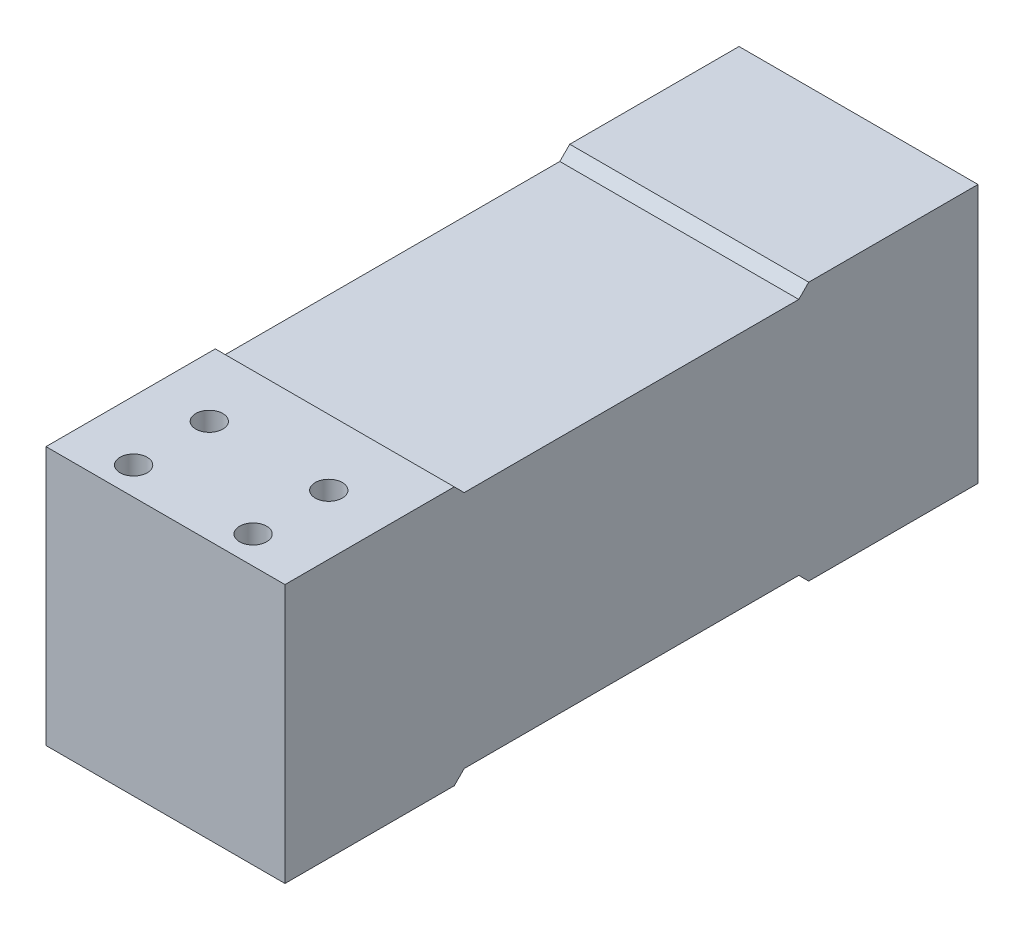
ISO-10303-21;
HEADER;
FILE_DESCRIPTION(('STEP AP214'),'2;1');
FILE_NAME('part.step','',(''),(''),'','','');
FILE_SCHEMA(('AUTOMOTIVE_DESIGN { 1 0 10303 214 1 1 1 1 }'));
ENDSEC;
DATA;
#1=APPLICATION_CONTEXT('core data for automotive mechanical design processes');
#2=APPLICATION_PROTOCOL_DEFINITION('international standard','automotive_design',2000,#1);
#3=PRODUCT_CONTEXT('',#1,'mechanical');
#4=PRODUCT('Part','Part','',(#3));
#5=PRODUCT_RELATED_PRODUCT_CATEGORY('part','',(#4));
#6=PRODUCT_DEFINITION_FORMATION('','',#4);
#7=PRODUCT_DEFINITION_CONTEXT('part definition',#1,'design');
#8=PRODUCT_DEFINITION('design','',#6,#7);
#9=PRODUCT_DEFINITION_SHAPE('','',#8);
#10=(LENGTH_UNIT() NAMED_UNIT(*) SI_UNIT(.MILLI.,.METRE.));
#11=(NAMED_UNIT(*) PLANE_ANGLE_UNIT() SI_UNIT($,.RADIAN.));
#12=(NAMED_UNIT(*) SI_UNIT($,.STERADIAN.) SOLID_ANGLE_UNIT());
#13=UNCERTAINTY_MEASURE_WITH_UNIT(LENGTH_MEASURE(1.E-05),#10,'distance_accuracy_value','');
#14=(GEOMETRIC_REPRESENTATION_CONTEXT(3) GLOBAL_UNCERTAINTY_ASSIGNED_CONTEXT((#13)) GLOBAL_UNIT_ASSIGNED_CONTEXT((#10,
#11,#12)) REPRESENTATION_CONTEXT('',''));
#15=CARTESIAN_POINT('',(0.,0.,0.));
#16=DIRECTION('',(0.,0.,1.));
#17=DIRECTION('',(1.,0.,0.));
#18=AXIS2_PLACEMENT_3D('',#15,#16,#17);
#19=CARTESIAN_POINT('',(30.,0.,0.));
#20=DIRECTION('',(0.,0.,-1.));
#21=DIRECTION('',(-1.,0.,0.));
#22=AXIS2_PLACEMENT_3D('',#19,#20,#21);
#23=PLANE('',#22);
#24=DIRECTION('',(0.,-1.,0.));
#25=VECTOR('',#24,1.);
#26=CARTESIAN_POINT('',(-30.,0.,0.));
#27=LINE('',#26,#25);
#28=CARTESIAN_POINT('',(-30.,65.,0.));
#29=VERTEX_POINT('',#28);
#30=CARTESIAN_POINT('',(-30.,0.,0.));
#31=VERTEX_POINT('',#30);
#32=EDGE_CURVE('E159',#29,#31,#27,.T.);
#33=ORIENTED_EDGE('',*,*,#32,.T.);
#34=DIRECTION('',(-1.,0.,0.));
#35=VECTOR('',#34,1.);
#36=CARTESIAN_POINT('',(30.,0.,0.));
#37=LINE('',#36,#35);
#38=CARTESIAN_POINT('',(30.,0.,0.));
#39=VERTEX_POINT('',#38);
#40=EDGE_CURVE('E11',#39,#31,#37,.T.);
#41=ORIENTED_EDGE('',*,*,#40,.F.);
#42=DIRECTION('',(0.,-1.,0.));
#43=VECTOR('',#42,1.);
#44=CARTESIAN_POINT('',(30.,0.,0.));
#45=LINE('',#44,#43);
#46=CARTESIAN_POINT('',(30.,65.,0.));
#47=VERTEX_POINT('',#46);
#48=EDGE_CURVE('E182',#47,#39,#45,.T.);
#49=ORIENTED_EDGE('',*,*,#48,.F.);
#50=DIRECTION('',(-1.,0.,0.));
#51=VECTOR('',#50,1.);
#52=CARTESIAN_POINT('',(30.,65.,0.));
#53=LINE('',#52,#51);
#54=EDGE_CURVE('E155',#47,#29,#53,.T.);
#55=ORIENTED_EDGE('',*,*,#54,.T.);
#56=EDGE_LOOP('',(#33,#41,#49,#55));
#57=FACE_BOUND('',#56,.T.);
#58=ADVANCED_FACE('F36',(#57),#23,.F.);
#59=CARTESIAN_POINT('',(30.,0.,0.));
#60=DIRECTION('',(0.,1.,0.));
#61=DIRECTION('',(0.,0.,1.));
#62=AXIS2_PLACEMENT_3D('',#59,#60,#61);
#63=PLANE('',#62);
#64=DIRECTION('',(0.,0.,-1.));
#65=VECTOR('',#64,1.);
#66=CARTESIAN_POINT('',(-30.,0.,0.));
#67=LINE('',#66,#65);
#68=CARTESIAN_POINT('',(-30.,0.,-42.5));
#69=VERTEX_POINT('',#68);
#70=EDGE_CURVE('E162',#31,#69,#67,.T.);
#71=ORIENTED_EDGE('',*,*,#70,.T.);
#72=DIRECTION('',(-1.,0.,0.));
#73=VECTOR('',#72,1.);
#74=CARTESIAN_POINT('',(30.,0.,-42.5));
#75=LINE('',#74,#73);
#76=CARTESIAN_POINT('',(30.,0.,-42.5));
#77=VERTEX_POINT('',#76);
#78=EDGE_CURVE('E44',#77,#69,#75,.T.);
#79=ORIENTED_EDGE('',*,*,#78,.F.);
#80=DIRECTION('',(0.,0.,-1.));
#81=VECTOR('',#80,1.);
#82=CARTESIAN_POINT('',(30.,0.,0.));
#83=LINE('',#82,#81);
#84=EDGE_CURVE('E108',#39,#77,#83,.T.);
#85=ORIENTED_EDGE('',*,*,#84,.F.);
#86=ORIENTED_EDGE('',*,*,#40,.T.);
#87=EDGE_LOOP('',(#71,#79,#85,#86));
#88=FACE_BOUND('',#87,.T.);
#89=ADVANCED_FACE('F263',(#88),#63,.F.);
#90=CARTESIAN_POINT('',(30.,0.,-42.5));
#91=DIRECTION('',(0.,0.707106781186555,0.70710678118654));
#92=DIRECTION('',(0.,-0.70710678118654,0.707106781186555));
#93=AXIS2_PLACEMENT_3D('',#90,#91,#92);
#94=PLANE('',#93);
#95=DIRECTION('',(0.,0.70710678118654,-0.707106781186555));
#96=VECTOR('',#95,1.);
#97=CARTESIAN_POINT('',(-30.,0.,-42.5));
#98=LINE('',#97,#96);
#99=CARTESIAN_POINT('',(-30.,2.50000000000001,-45.0000000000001));
#100=VERTEX_POINT('',#99);
#101=EDGE_CURVE('E165',#69,#100,#98,.T.);
#102=ORIENTED_EDGE('',*,*,#101,.T.);
#103=DIRECTION('',(-1.,0.,0.));
#104=VECTOR('',#103,1.);
#105=CARTESIAN_POINT('',(30.,2.50000000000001,-45.0000000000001));
#106=LINE('',#105,#104);
#107=CARTESIAN_POINT('',(30.,2.50000000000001,-45.0000000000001));
#108=VERTEX_POINT('',#107);
#109=EDGE_CURVE('E201',#108,#100,#106,.T.);
#110=ORIENTED_EDGE('',*,*,#109,.F.);
#111=DIRECTION('',(0.,0.70710678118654,-0.707106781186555));
#112=VECTOR('',#111,1.);
#113=CARTESIAN_POINT('',(30.,0.,-42.5));
#114=LINE('',#113,#112);
#115=EDGE_CURVE('E209',#77,#108,#114,.T.);
#116=ORIENTED_EDGE('',*,*,#115,.F.);
#117=ORIENTED_EDGE('',*,*,#78,.T.);
#118=EDGE_LOOP('',(#102,#110,#116,#117));
#119=FACE_BOUND('',#118,.T.);
#120=ADVANCED_FACE('F207',(#119),#94,.F.);
#121=CARTESIAN_POINT('',(30.,2.50000000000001,-45.0000000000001));
#122=DIRECTION('',(0.,1.,0.));
#123=DIRECTION('',(0.,0.,1.));
#124=AXIS2_PLACEMENT_3D('',#121,#122,#123);
#125=PLANE('',#124);
#126=DIRECTION('',(0.,0.,-1.));
#127=VECTOR('',#126,1.);
#128=CARTESIAN_POINT('',(-30.,2.50000000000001,-45.0000000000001));
#129=LINE('',#128,#127);
#130=CARTESIAN_POINT('',(-30.,2.50000000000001,-129.));
#131=VERTEX_POINT('',#130);
#132=EDGE_CURVE('E167',#100,#131,#129,.T.);
#133=ORIENTED_EDGE('',*,*,#132,.T.);
#134=DIRECTION('',(-1.,0.,0.));
#135=VECTOR('',#134,1.);
#136=CARTESIAN_POINT('',(30.,2.50000000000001,-129.));
#137=LINE('',#136,#135);
#138=CARTESIAN_POINT('',(30.,2.50000000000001,-129.));
#139=VERTEX_POINT('',#138);
#140=EDGE_CURVE('E198',#139,#131,#137,.T.);
#141=ORIENTED_EDGE('',*,*,#140,.F.);
#142=DIRECTION('',(0.,0.,-1.));
#143=VECTOR('',#142,1.);
#144=CARTESIAN_POINT('',(30.,2.50000000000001,-45.0000000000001));
#145=LINE('',#144,#143);
#146=EDGE_CURVE('E227',#108,#139,#145,.T.);
#147=ORIENTED_EDGE('',*,*,#146,.F.);
#148=ORIENTED_EDGE('',*,*,#109,.T.);
#149=EDGE_LOOP('',(#133,#141,#147,#148));
#150=FACE_BOUND('',#149,.T.);
#151=ADVANCED_FACE('F218',(#150),#125,.F.);
#152=CARTESIAN_POINT('',(30.,0.,-131.5));
#153=DIRECTION('',(0.,0.707106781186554,-0.707106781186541));
#154=DIRECTION('',(0.,0.707106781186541,0.707106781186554));
#155=AXIS2_PLACEMENT_3D('',#152,#153,#154);
#156=PLANE('',#155);
#157=DIRECTION('',(0.,-0.707106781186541,-0.707106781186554));
#158=VECTOR('',#157,1.);
#159=CARTESIAN_POINT('',(-30.,0.,-131.5));
#160=LINE('',#159,#158);
#161=CARTESIAN_POINT('',(-30.,0.,-131.5));
#162=VERTEX_POINT('',#161);
#163=EDGE_CURVE('E169',#131,#162,#160,.T.);
#164=ORIENTED_EDGE('',*,*,#163,.T.);
#165=DIRECTION('',(-1.,0.,0.));
#166=VECTOR('',#165,1.);
#167=CARTESIAN_POINT('',(30.,0.,-131.5));
#168=LINE('',#167,#166);
#169=CARTESIAN_POINT('',(30.,0.,-131.5));
#170=VERTEX_POINT('',#169);
#171=EDGE_CURVE('E195',#170,#162,#168,.T.);
#172=ORIENTED_EDGE('',*,*,#171,.F.);
#173=DIRECTION('',(0.,-0.707106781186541,-0.707106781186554));
#174=VECTOR('',#173,1.);
#175=CARTESIAN_POINT('',(30.,0.,-131.5));
#176=LINE('',#175,#174);
#177=EDGE_CURVE('E224',#139,#170,#176,.T.);
#178=ORIENTED_EDGE('',*,*,#177,.F.);
#179=ORIENTED_EDGE('',*,*,#140,.T.);
#180=EDGE_LOOP('',(#164,#172,#178,#179));
#181=FACE_BOUND('',#180,.T.);
#182=ADVANCED_FACE('F222',(#181),#156,.F.);
#183=CARTESIAN_POINT('',(30.,0.,-131.5));
#184=DIRECTION('',(0.,1.,0.));
#185=DIRECTION('',(0.,0.,1.));
#186=AXIS2_PLACEMENT_3D('',#183,#184,#185);
#187=PLANE('',#186);
#188=CARTESIAN_POINT('',(15.,0.,-148.));
#189=DIRECTION('',(0.,-1.,0.));
#190=DIRECTION('',(0.,0.,-1.));
#191=AXIS2_PLACEMENT_3D('',#188,#189,#190);
#192=CIRCLE('',#191,3.39999999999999);
#193=CARTESIAN_POINT('',(15.,0.,-151.4));
#194=VERTEX_POINT('',#193);
#195=EDGE_CURVE('E524',#194,#194,#192,.T.);
#196=ORIENTED_EDGE('',*,*,#195,.F.);
#197=EDGE_LOOP('',(#196));
#198=FACE_BOUND('',#197,.T.);
#199=CARTESIAN_POINT('',(15.,0.,-167.));
#200=DIRECTION('',(0.,-1.,0.));
#201=DIRECTION('',(0.,0.,-1.));
#202=AXIS2_PLACEMENT_3D('',#199,#200,#201);
#203=CIRCLE('',#202,3.39999999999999);
#204=CARTESIAN_POINT('',(15.,0.,-170.4));
#205=VERTEX_POINT('',#204);
#206=EDGE_CURVE('E526',#205,#205,#203,.T.);
#207=ORIENTED_EDGE('',*,*,#206,.F.);
#208=EDGE_LOOP('',(#207));
#209=FACE_BOUND('',#208,.T.);
#210=CARTESIAN_POINT('',(-15.,0.,-148.));
#211=DIRECTION('',(0.,-1.,0.));
#212=DIRECTION('',(0.,0.,-1.));
#213=AXIS2_PLACEMENT_3D('',#210,#211,#212);
#214=CIRCLE('',#213,3.39999999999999);
#215=CARTESIAN_POINT('',(-15.,0.,-151.4));
#216=VERTEX_POINT('',#215);
#217=EDGE_CURVE('E534',#216,#216,#214,.T.);
#218=ORIENTED_EDGE('',*,*,#217,.F.);
#219=EDGE_LOOP('',(#218));
#220=FACE_BOUND('',#219,.T.);
#221=CARTESIAN_POINT('',(-15.,0.,-167.));
#222=DIRECTION('',(0.,-1.,0.));
#223=DIRECTION('',(0.,0.,-1.));
#224=AXIS2_PLACEMENT_3D('',#221,#222,#223);
#225=CIRCLE('',#224,3.39999999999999);
#226=CARTESIAN_POINT('',(-15.,0.,-170.4));
#227=VERTEX_POINT('',#226);
#228=EDGE_CURVE('E540',#227,#227,#225,.T.);
#229=ORIENTED_EDGE('',*,*,#228,.F.);
#230=EDGE_LOOP('',(#229));
#231=FACE_BOUND('',#230,.T.);
#232=DIRECTION('',(0.,0.,-1.));
#233=VECTOR('',#232,1.);
#234=CARTESIAN_POINT('',(-30.,0.,-131.5));
#235=LINE('',#234,#233);
#236=CARTESIAN_POINT('',(-30.,0.,-174.));
#237=VERTEX_POINT('',#236);
#238=EDGE_CURVE('E171',#162,#237,#235,.T.);
#239=ORIENTED_EDGE('',*,*,#238,.T.);
#240=DIRECTION('',(-1.,0.,0.));
#241=VECTOR('',#240,1.);
#242=CARTESIAN_POINT('',(30.,0.,-174.));
#243=LINE('',#242,#241);
#244=CARTESIAN_POINT('',(30.,0.,-174.));
#245=VERTEX_POINT('',#244);
#246=EDGE_CURVE('E192',#245,#237,#243,.T.);
#247=ORIENTED_EDGE('',*,*,#246,.F.);
#248=DIRECTION('',(0.,0.,-1.));
#249=VECTOR('',#248,1.);
#250=CARTESIAN_POINT('',(30.,0.,-131.5));
#251=LINE('',#250,#249);
#252=EDGE_CURVE('E226',#170,#245,#251,.T.);
#253=ORIENTED_EDGE('',*,*,#252,.F.);
#254=ORIENTED_EDGE('',*,*,#171,.T.);
#255=EDGE_LOOP('',(#239,#247,#253,#254));
#256=FACE_BOUND('',#255,.T.);
#257=ADVANCED_FACE('F276',(#198,#209,#220,#231,#256),#187,.F.);
#258=CARTESIAN_POINT('',(30.,0.,-174.));
#259=DIRECTION('',(0.,0.,1.));
#260=DIRECTION('',(1.,0.,0.));
#261=AXIS2_PLACEMENT_3D('',#258,#259,#260);
#262=PLANE('',#261);
#263=DIRECTION('',(0.,1.,0.));
#264=VECTOR('',#263,1.);
#265=CARTESIAN_POINT('',(-30.,0.,-174.));
#266=LINE('',#265,#264);
#267=CARTESIAN_POINT('',(-30.,65.,-174.));
#268=VERTEX_POINT('',#267);
#269=EDGE_CURVE('E173',#237,#268,#266,.T.);
#270=ORIENTED_EDGE('',*,*,#269,.T.);
#271=DIRECTION('',(-1.,0.,0.));
#272=VECTOR('',#271,1.);
#273=CARTESIAN_POINT('',(30.,65.,-174.));
#274=LINE('',#273,#272);
#275=CARTESIAN_POINT('',(30.,65.,-174.));
#276=VERTEX_POINT('',#275);
#277=EDGE_CURVE('E189',#276,#268,#274,.T.);
#278=ORIENTED_EDGE('',*,*,#277,.F.);
#279=DIRECTION('',(0.,1.,0.));
#280=VECTOR('',#279,1.);
#281=CARTESIAN_POINT('',(30.,0.,-174.));
#282=LINE('',#281,#280);
#283=EDGE_CURVE('E229',#245,#276,#282,.T.);
#284=ORIENTED_EDGE('',*,*,#283,.F.);
#285=ORIENTED_EDGE('',*,*,#246,.T.);
#286=EDGE_LOOP('',(#270,#278,#284,#285));
#287=FACE_BOUND('',#286,.T.);
#288=ADVANCED_FACE('F279',(#287),#262,.F.);
#289=CARTESIAN_POINT('',(30.,65.,-131.5));
#290=DIRECTION('',(0.,-1.,0.));
#291=DIRECTION('',(0.,0.,-1.));
#292=AXIS2_PLACEMENT_3D('',#289,#290,#291);
#293=PLANE('',#292);
#294=DIRECTION('',(0.,0.,1.));
#295=VECTOR('',#294,1.);
#296=CARTESIAN_POINT('',(-30.,65.,-131.5));
#297=LINE('',#296,#295);
#298=CARTESIAN_POINT('',(-30.,65.,-131.5));
#299=VERTEX_POINT('',#298);
#300=EDGE_CURVE('E175',#268,#299,#297,.T.);
#301=ORIENTED_EDGE('',*,*,#300,.T.);
#302=DIRECTION('',(-1.,0.,0.));
#303=VECTOR('',#302,1.);
#304=CARTESIAN_POINT('',(30.,65.,-131.5));
#305=LINE('',#304,#303);
#306=CARTESIAN_POINT('',(30.,65.,-131.5));
#307=VERTEX_POINT('',#306);
#308=EDGE_CURVE('E186',#307,#299,#305,.T.);
#309=ORIENTED_EDGE('',*,*,#308,.F.);
#310=DIRECTION('',(0.,0.,1.));
#311=VECTOR('',#310,1.);
#312=CARTESIAN_POINT('',(30.,65.,-131.5));
#313=LINE('',#312,#311);
#314=EDGE_CURVE('E235',#276,#307,#313,.T.);
#315=ORIENTED_EDGE('',*,*,#314,.F.);
#316=ORIENTED_EDGE('',*,*,#277,.T.);
#317=EDGE_LOOP('',(#301,#309,#315,#316));
#318=FACE_BOUND('',#317,.T.);
#319=ADVANCED_FACE('F241',(#318),#293,.F.);
#320=CARTESIAN_POINT('',(30.,65.,-131.5));
#321=DIRECTION('',(0.,-0.707106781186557,-0.707106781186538));
#322=DIRECTION('',(0.,0.707106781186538,-0.707106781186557));
#323=AXIS2_PLACEMENT_3D('',#320,#321,#322);
#324=PLANE('',#323);
#325=DIRECTION('',(0.,-0.707106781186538,0.707106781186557));
#326=VECTOR('',#325,1.);
#327=CARTESIAN_POINT('',(-30.,65.,-131.5));
#328=LINE('',#327,#326);
#329=CARTESIAN_POINT('',(-30.,62.5,-129.));
#330=VERTEX_POINT('',#329);
#331=EDGE_CURVE('E177',#299,#330,#328,.T.);
#332=ORIENTED_EDGE('',*,*,#331,.T.);
#333=DIRECTION('',(-1.,0.,0.));
#334=VECTOR('',#333,1.);
#335=CARTESIAN_POINT('',(30.,62.5,-129.));
#336=LINE('',#335,#334);
#337=CARTESIAN_POINT('',(30.,62.5,-129.));
#338=VERTEX_POINT('',#337);
#339=EDGE_CURVE('E150',#338,#330,#336,.T.);
#340=ORIENTED_EDGE('',*,*,#339,.F.);
#341=DIRECTION('',(0.,-0.707106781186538,0.707106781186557));
#342=VECTOR('',#341,1.);
#343=CARTESIAN_POINT('',(30.,65.,-131.5));
#344=LINE('',#343,#342);
#345=EDGE_CURVE('E141',#307,#338,#344,.T.);
#346=ORIENTED_EDGE('',*,*,#345,.F.);
#347=ORIENTED_EDGE('',*,*,#308,.T.);
#348=EDGE_LOOP('',(#332,#340,#346,#347));
#349=FACE_BOUND('',#348,.T.);
#350=ADVANCED_FACE('F245',(#349),#324,.F.);
#351=CARTESIAN_POINT('',(30.,62.5,-45.));
#352=DIRECTION('',(0.,-1.,0.));
#353=DIRECTION('',(0.,0.,-1.));
#354=AXIS2_PLACEMENT_3D('',#351,#352,#353);
#355=PLANE('',#354);
#356=DIRECTION('',(0.,0.,1.));
#357=VECTOR('',#356,1.);
#358=CARTESIAN_POINT('',(-30.,62.5,-45.));
#359=LINE('',#358,#357);
#360=CARTESIAN_POINT('',(-30.,62.5,-45.));
#361=VERTEX_POINT('',#360);
#362=EDGE_CURVE('E149',#330,#361,#359,.T.);
#363=ORIENTED_EDGE('',*,*,#362,.T.);
#364=DIRECTION('',(-1.,0.,0.));
#365=VECTOR('',#364,1.);
#366=CARTESIAN_POINT('',(30.,62.5,-45.));
#367=LINE('',#366,#365);
#368=CARTESIAN_POINT('',(30.,62.5,-45.));
#369=VERTEX_POINT('',#368);
#370=EDGE_CURVE('E146',#369,#361,#367,.T.);
#371=ORIENTED_EDGE('',*,*,#370,.F.);
#372=DIRECTION('',(0.,0.,1.));
#373=VECTOR('',#372,1.);
#374=CARTESIAN_POINT('',(30.,62.5,-45.));
#375=LINE('',#374,#373);
#376=EDGE_CURVE('E135',#338,#369,#375,.T.);
#377=ORIENTED_EDGE('',*,*,#376,.F.);
#378=ORIENTED_EDGE('',*,*,#339,.T.);
#379=EDGE_LOOP('',(#363,#371,#377,#378));
#380=FACE_BOUND('',#379,.T.);
#381=ADVANCED_FACE('F147',(#380),#355,.F.);
#382=CARTESIAN_POINT('',(30.,65.,-42.5));
#383=DIRECTION('',(0.,-0.707106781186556,0.707106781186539));
#384=DIRECTION('',(0.,-0.707106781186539,-0.707106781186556));
#385=AXIS2_PLACEMENT_3D('',#382,#383,#384);
#386=PLANE('',#385);
#387=DIRECTION('',(0.,0.707106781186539,0.707106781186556));
#388=VECTOR('',#387,1.);
#389=CARTESIAN_POINT('',(-30.,65.,-42.5));
#390=LINE('',#389,#388);
#391=CARTESIAN_POINT('',(-30.,65.,-42.5));
#392=VERTEX_POINT('',#391);
#393=EDGE_CURVE('E94',#361,#392,#390,.T.);
#394=ORIENTED_EDGE('',*,*,#393,.T.);
#395=DIRECTION('',(-1.,0.,0.));
#396=VECTOR('',#395,1.);
#397=CARTESIAN_POINT('',(30.,65.,-42.5));
#398=LINE('',#397,#396);
#399=CARTESIAN_POINT('',(30.,65.,-42.5));
#400=VERTEX_POINT('',#399);
#401=EDGE_CURVE('E151',#400,#392,#398,.T.);
#402=ORIENTED_EDGE('',*,*,#401,.F.);
#403=DIRECTION('',(0.,0.707106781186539,0.707106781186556));
#404=VECTOR('',#403,1.);
#405=CARTESIAN_POINT('',(30.,65.,-42.5));
#406=LINE('',#405,#404);
#407=EDGE_CURVE('E139',#369,#400,#406,.T.);
#408=ORIENTED_EDGE('',*,*,#407,.F.);
#409=ORIENTED_EDGE('',*,*,#370,.T.);
#410=EDGE_LOOP('',(#394,#402,#408,#409));
#411=FACE_BOUND('',#410,.T.);
#412=ADVANCED_FACE('F153',(#411),#386,.F.);
#413=CARTESIAN_POINT('',(30.,65.,0.));
#414=DIRECTION('',(0.,-1.,0.));
#415=DIRECTION('',(0.,0.,-1.));
#416=AXIS2_PLACEMENT_3D('',#413,#414,#415);
#417=PLANE('',#416);
#418=CARTESIAN_POINT('',(15.,65.,-26.));
#419=DIRECTION('',(0.,1.,0.));
#420=DIRECTION('',(0.,0.,1.));
#421=AXIS2_PLACEMENT_3D('',#418,#419,#420);
#422=CIRCLE('',#421,3.4);
#423=CARTESIAN_POINT('',(15.,65.,-22.6));
#424=VERTEX_POINT('',#423);
#425=EDGE_CURVE('E546',#424,#424,#422,.T.);
#426=ORIENTED_EDGE('',*,*,#425,.F.);
#427=EDGE_LOOP('',(#426));
#428=FACE_BOUND('',#427,.T.);
#429=CARTESIAN_POINT('',(15.,65.,-7.));
#430=DIRECTION('',(0.,1.,0.));
#431=DIRECTION('',(0.,0.,1.));
#432=AXIS2_PLACEMENT_3D('',#429,#430,#431);
#433=CIRCLE('',#432,3.4);
#434=CARTESIAN_POINT('',(15.,65.,-3.6));
#435=VERTEX_POINT('',#434);
#436=EDGE_CURVE('E552',#435,#435,#433,.T.);
#437=ORIENTED_EDGE('',*,*,#436,.F.);
#438=EDGE_LOOP('',(#437));
#439=FACE_BOUND('',#438,.T.);
#440=CARTESIAN_POINT('',(-15.,65.,-26.));
#441=DIRECTION('',(0.,1.,0.));
#442=DIRECTION('',(0.,0.,1.));
#443=AXIS2_PLACEMENT_3D('',#440,#441,#442);
#444=CIRCLE('',#443,3.4);
#445=CARTESIAN_POINT('',(-15.,65.,-22.6));
#446=VERTEX_POINT('',#445);
#447=EDGE_CURVE('E558',#446,#446,#444,.T.);
#448=ORIENTED_EDGE('',*,*,#447,.F.);
#449=EDGE_LOOP('',(#448));
#450=FACE_BOUND('',#449,.T.);
#451=CARTESIAN_POINT('',(-15.,65.,-7.));
#452=DIRECTION('',(0.,1.,0.));
#453=DIRECTION('',(0.,0.,1.));
#454=AXIS2_PLACEMENT_3D('',#451,#452,#453);
#455=CIRCLE('',#454,3.4);
#456=CARTESIAN_POINT('',(-15.,65.,-3.6));
#457=VERTEX_POINT('',#456);
#458=EDGE_CURVE('E564',#457,#457,#455,.T.);
#459=ORIENTED_EDGE('',*,*,#458,.F.);
#460=EDGE_LOOP('',(#459));
#461=FACE_BOUND('',#460,.T.);
#462=DIRECTION('',(0.,0.,1.));
#463=VECTOR('',#462,1.);
#464=CARTESIAN_POINT('',(-30.,65.,0.));
#465=LINE('',#464,#463);
#466=EDGE_CURVE('E100',#392,#29,#465,.T.);
#467=ORIENTED_EDGE('',*,*,#466,.T.);
#468=ORIENTED_EDGE('',*,*,#54,.F.);
#469=DIRECTION('',(0.,0.,1.));
#470=VECTOR('',#469,1.);
#471=CARTESIAN_POINT('',(30.,65.,0.));
#472=LINE('',#471,#470);
#473=EDGE_CURVE('E52',#400,#47,#472,.T.);
#474=ORIENTED_EDGE('',*,*,#473,.F.);
#475=ORIENTED_EDGE('',*,*,#401,.T.);
#476=EDGE_LOOP('',(#467,#468,#474,#475));
#477=FACE_BOUND('',#476,.T.);
#478=ADVANCED_FACE('F249',(#428,#439,#450,#461,#477),#417,.F.);
#479=CARTESIAN_POINT('',(30.,65.,0.));
#480=DIRECTION('',(-1.,0.,0.));
#481=DIRECTION('',(0.,0.,1.));
#482=AXIS2_PLACEMENT_3D('',#479,#480,#481);
#483=PLANE('',#482);
#484=ORIENTED_EDGE('',*,*,#48,.T.);
#485=ORIENTED_EDGE('',*,*,#84,.T.);
#486=ORIENTED_EDGE('',*,*,#115,.T.);
#487=ORIENTED_EDGE('',*,*,#146,.T.);
#488=ORIENTED_EDGE('',*,*,#177,.T.);
#489=ORIENTED_EDGE('',*,*,#252,.T.);
#490=ORIENTED_EDGE('',*,*,#283,.T.);
#491=ORIENTED_EDGE('',*,*,#314,.T.);
#492=ORIENTED_EDGE('',*,*,#345,.T.);
#493=ORIENTED_EDGE('',*,*,#376,.T.);
#494=ORIENTED_EDGE('',*,*,#407,.T.);
#495=ORIENTED_EDGE('',*,*,#473,.T.);
#496=EDGE_LOOP('',(#484,#485,#486,#487,#488,#489,#490,#491,#492,#493,#494,#495));
#497=FACE_BOUND('',#496,.T.);
#498=ADVANCED_FACE('F137',(#497),#483,.F.);
#499=CARTESIAN_POINT('',(-30.,65.,0.));
#500=DIRECTION('',(-1.,0.,0.));
#501=DIRECTION('',(0.,0.,1.));
#502=AXIS2_PLACEMENT_3D('',#499,#500,#501);
#503=PLANE('',#502);
#504=ORIENTED_EDGE('',*,*,#32,.F.);
#505=ORIENTED_EDGE('',*,*,#466,.F.);
#506=ORIENTED_EDGE('',*,*,#393,.F.);
#507=ORIENTED_EDGE('',*,*,#362,.F.);
#508=ORIENTED_EDGE('',*,*,#331,.F.);
#509=ORIENTED_EDGE('',*,*,#300,.F.);
#510=ORIENTED_EDGE('',*,*,#269,.F.);
#511=ORIENTED_EDGE('',*,*,#238,.F.);
#512=ORIENTED_EDGE('',*,*,#163,.F.);
#513=ORIENTED_EDGE('',*,*,#132,.F.);
#514=ORIENTED_EDGE('',*,*,#101,.F.);
#515=ORIENTED_EDGE('',*,*,#70,.F.);
#516=EDGE_LOOP('',(#504,#505,#506,#507,#508,#509,#510,#511,#512,#513,#514,#515));
#517=FACE_BOUND('',#516,.T.);
#518=ADVANCED_FACE('F213',(#517),#503,.T.);
#519=CARTESIAN_POINT('',(-15.,39.9999992,-7.));
#520=DIRECTION('',(0.,1.,0.));
#521=DIRECTION('',(0.,0.,1.));
#522=AXIS2_PLACEMENT_3D('',#519,#520,#521);
#523=CONICAL_SURFACE('',#522,3.39999999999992,1.02974425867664);
#524=CARTESIAN_POINT('',(-15.,37.9570730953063,-7.));
#525=VERTEX_POINT('',#524);
#526=VERTEX_LOOP('',#525);
#527=FACE_BOUND('',#526,.T.);
#528=CARTESIAN_POINT('',(-15.,39.9999992,-7.));
#529=DIRECTION('',(0.,1.,0.));
#530=DIRECTION('',(0.,0.,1.));
#531=AXIS2_PLACEMENT_3D('',#528,#529,#530);
#532=CIRCLE('',#531,3.39999999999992);
#533=CARTESIAN_POINT('',(-15.,39.9999992,-3.60000000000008));
#534=VERTEX_POINT('',#533);
#535=EDGE_CURVE('E163',#534,#534,#532,.T.);
#536=ORIENTED_EDGE('',*,*,#535,.T.);
#537=EDGE_LOOP('',(#536));
#538=FACE_BOUND('',#537,.T.);
#539=ADVANCED_FACE('F313',(#527,#538),#523,.F.);
#540=CARTESIAN_POINT('',(-15.,65.,-7.));
#541=DIRECTION('',(0.,1.,0.));
#542=DIRECTION('',(0.,0.,1.));
#543=AXIS2_PLACEMENT_3D('',#540,#541,#542);
#544=CYLINDRICAL_SURFACE('',#543,3.39999999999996);
#545=ORIENTED_EDGE('',*,*,#535,.F.);
#546=EDGE_LOOP('',(#545));
#547=FACE_BOUND('',#546,.T.);
#548=ORIENTED_EDGE('',*,*,#458,.T.);
#549=EDGE_LOOP('',(#548));
#550=FACE_BOUND('',#549,.T.);
#551=ADVANCED_FACE('F321',(#547,#550),#544,.F.);
#552=CARTESIAN_POINT('',(-15.,39.9999992,-26.));
#553=DIRECTION('',(0.,1.,0.));
#554=DIRECTION('',(0.,0.,1.));
#555=AXIS2_PLACEMENT_3D('',#552,#553,#554);
#556=CONICAL_SURFACE('',#555,3.39999999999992,1.02974425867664);
#557=CARTESIAN_POINT('',(-15.,37.9570730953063,-26.));
#558=VERTEX_POINT('',#557);
#559=VERTEX_LOOP('',#558);
#560=FACE_BOUND('',#559,.T.);
#561=CARTESIAN_POINT('',(-15.,39.9999992,-26.));
#562=DIRECTION('',(0.,1.,0.));
#563=DIRECTION('',(0.,0.,1.));
#564=AXIS2_PLACEMENT_3D('',#561,#562,#563);
#565=CIRCLE('',#564,3.39999999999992);
#566=CARTESIAN_POINT('',(-15.,39.9999992,-22.6000000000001));
#567=VERTEX_POINT('',#566);
#568=EDGE_CURVE('E561',#567,#567,#565,.T.);
#569=ORIENTED_EDGE('',*,*,#568,.T.);
#570=EDGE_LOOP('',(#569));
#571=FACE_BOUND('',#570,.T.);
#572=ADVANCED_FACE('F331',(#560,#571),#556,.F.);
#573=CARTESIAN_POINT('',(-15.,65.,-26.));
#574=DIRECTION('',(0.,1.,0.));
#575=DIRECTION('',(0.,0.,1.));
#576=AXIS2_PLACEMENT_3D('',#573,#574,#575);
#577=CYLINDRICAL_SURFACE('',#576,3.39999999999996);
#578=ORIENTED_EDGE('',*,*,#568,.F.);
#579=EDGE_LOOP('',(#578));
#580=FACE_BOUND('',#579,.T.);
#581=ORIENTED_EDGE('',*,*,#447,.T.);
#582=EDGE_LOOP('',(#581));
#583=FACE_BOUND('',#582,.T.);
#584=ADVANCED_FACE('F347',(#580,#583),#577,.F.);
#585=CARTESIAN_POINT('',(15.,39.9999992,-7.));
#586=DIRECTION('',(0.,1.,0.));
#587=DIRECTION('',(0.,0.,1.));
#588=AXIS2_PLACEMENT_3D('',#585,#586,#587);
#589=CONICAL_SURFACE('',#588,3.39999999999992,1.02974425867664);
#590=CARTESIAN_POINT('',(15.,37.9570730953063,-7.));
#591=VERTEX_POINT('',#590);
#592=VERTEX_LOOP('',#591);
#593=FACE_BOUND('',#592,.T.);
#594=CARTESIAN_POINT('',(15.,39.9999992,-7.));
#595=DIRECTION('',(0.,1.,0.));
#596=DIRECTION('',(0.,0.,1.));
#597=AXIS2_PLACEMENT_3D('',#594,#595,#596);
#598=CIRCLE('',#597,3.39999999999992);
#599=CARTESIAN_POINT('',(15.,39.9999992,-3.60000000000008));
#600=VERTEX_POINT('',#599);
#601=EDGE_CURVE('E555',#600,#600,#598,.T.);
#602=ORIENTED_EDGE('',*,*,#601,.T.);
#603=EDGE_LOOP('',(#602));
#604=FACE_BOUND('',#603,.T.);
#605=ADVANCED_FACE('F357',(#593,#604),#589,.F.);
#606=CARTESIAN_POINT('',(15.,65.,-7.));
#607=DIRECTION('',(0.,1.,0.));
#608=DIRECTION('',(0.,0.,1.));
#609=AXIS2_PLACEMENT_3D('',#606,#607,#608);
#610=CYLINDRICAL_SURFACE('',#609,3.39999999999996);
#611=ORIENTED_EDGE('',*,*,#601,.F.);
#612=EDGE_LOOP('',(#611));
#613=FACE_BOUND('',#612,.T.);
#614=ORIENTED_EDGE('',*,*,#436,.T.);
#615=EDGE_LOOP('',(#614));
#616=FACE_BOUND('',#615,.T.);
#617=ADVANCED_FACE('F369',(#613,#616),#610,.F.);
#618=CARTESIAN_POINT('',(15.,39.9999992,-26.));
#619=DIRECTION('',(0.,1.,0.));
#620=DIRECTION('',(0.,0.,1.));
#621=AXIS2_PLACEMENT_3D('',#618,#619,#620);
#622=CONICAL_SURFACE('',#621,3.39999999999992,1.02974425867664);
#623=CARTESIAN_POINT('',(15.,37.9570730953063,-26.));
#624=VERTEX_POINT('',#623);
#625=VERTEX_LOOP('',#624);
#626=FACE_BOUND('',#625,.T.);
#627=CARTESIAN_POINT('',(15.,39.9999992,-26.));
#628=DIRECTION('',(0.,1.,0.));
#629=DIRECTION('',(0.,0.,1.));
#630=AXIS2_PLACEMENT_3D('',#627,#628,#629);
#631=CIRCLE('',#630,3.39999999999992);
#632=CARTESIAN_POINT('',(15.,39.9999992,-22.6000000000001));
#633=VERTEX_POINT('',#632);
#634=EDGE_CURVE('E549',#633,#633,#631,.T.);
#635=ORIENTED_EDGE('',*,*,#634,.T.);
#636=EDGE_LOOP('',(#635));
#637=FACE_BOUND('',#636,.T.);
#638=ADVANCED_FACE('F379',(#626,#637),#622,.F.);
#639=CARTESIAN_POINT('',(15.,65.,-26.));
#640=DIRECTION('',(0.,1.,0.));
#641=DIRECTION('',(0.,0.,1.));
#642=AXIS2_PLACEMENT_3D('',#639,#640,#641);
#643=CYLINDRICAL_SURFACE('',#642,3.39999999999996);
#644=ORIENTED_EDGE('',*,*,#634,.F.);
#645=EDGE_LOOP('',(#644));
#646=FACE_BOUND('',#645,.T.);
#647=ORIENTED_EDGE('',*,*,#425,.T.);
#648=EDGE_LOOP('',(#647));
#649=FACE_BOUND('',#648,.T.);
#650=ADVANCED_FACE('F391',(#646,#649),#643,.F.);
#651=CARTESIAN_POINT('',(-15.,25.0000008,-167.));
#652=DIRECTION('',(0.,-1.,0.));
#653=DIRECTION('',(0.,0.,-1.));
#654=AXIS2_PLACEMENT_3D('',#651,#652,#653);
#655=CONICAL_SURFACE('',#654,3.39999999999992,1.02974425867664);
#656=CARTESIAN_POINT('',(-15.,27.0429269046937,-167.));
#657=VERTEX_POINT('',#656);
#658=VERTEX_LOOP('',#657);
#659=FACE_BOUND('',#658,.T.);
#660=CARTESIAN_POINT('',(-15.,25.0000008,-167.));
#661=DIRECTION('',(0.,-1.,0.));
#662=DIRECTION('',(0.,0.,-1.));
#663=AXIS2_PLACEMENT_3D('',#660,#661,#662);
#664=CIRCLE('',#663,3.39999999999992);
#665=CARTESIAN_POINT('',(-15.,25.0000008,-170.4));
#666=VERTEX_POINT('',#665);
#667=EDGE_CURVE('E543',#666,#666,#664,.T.);
#668=ORIENTED_EDGE('',*,*,#667,.T.);
#669=EDGE_LOOP('',(#668));
#670=FACE_BOUND('',#669,.T.);
#671=ADVANCED_FACE('F401',(#659,#670),#655,.F.);
#672=CARTESIAN_POINT('',(-15.,0.,-167.));
#673=DIRECTION('',(0.,-1.,0.));
#674=DIRECTION('',(0.,0.,-1.));
#675=AXIS2_PLACEMENT_3D('',#672,#673,#674);
#676=CYLINDRICAL_SURFACE('',#675,3.39999999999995);
#677=ORIENTED_EDGE('',*,*,#667,.F.);
#678=EDGE_LOOP('',(#677));
#679=FACE_BOUND('',#678,.T.);
#680=ORIENTED_EDGE('',*,*,#228,.T.);
#681=EDGE_LOOP('',(#680));
#682=FACE_BOUND('',#681,.T.);
#683=ADVANCED_FACE('F413',(#679,#682),#676,.F.);
#684=CARTESIAN_POINT('',(-15.,25.0000008,-148.));
#685=DIRECTION('',(0.,-1.,0.));
#686=DIRECTION('',(0.,0.,-1.));
#687=AXIS2_PLACEMENT_3D('',#684,#685,#686);
#688=CONICAL_SURFACE('',#687,3.39999999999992,1.02974425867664);
#689=CARTESIAN_POINT('',(-15.,27.0429269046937,-148.));
#690=VERTEX_POINT('',#689);
#691=VERTEX_LOOP('',#690);
#692=FACE_BOUND('',#691,.T.);
#693=CARTESIAN_POINT('',(-15.,25.0000008,-148.));
#694=DIRECTION('',(0.,-1.,0.));
#695=DIRECTION('',(0.,0.,-1.));
#696=AXIS2_PLACEMENT_3D('',#693,#694,#695);
#697=CIRCLE('',#696,3.39999999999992);
#698=CARTESIAN_POINT('',(-15.,25.0000008,-151.4));
#699=VERTEX_POINT('',#698);
#700=EDGE_CURVE('E537',#699,#699,#697,.T.);
#701=ORIENTED_EDGE('',*,*,#700,.T.);
#702=EDGE_LOOP('',(#701));
#703=FACE_BOUND('',#702,.T.);
#704=ADVANCED_FACE('F423',(#692,#703),#688,.F.);
#705=CARTESIAN_POINT('',(-15.,0.,-148.));
#706=DIRECTION('',(0.,-1.,0.));
#707=DIRECTION('',(0.,0.,-1.));
#708=AXIS2_PLACEMENT_3D('',#705,#706,#707);
#709=CYLINDRICAL_SURFACE('',#708,3.39999999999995);
#710=ORIENTED_EDGE('',*,*,#700,.F.);
#711=EDGE_LOOP('',(#710));
#712=FACE_BOUND('',#711,.T.);
#713=ORIENTED_EDGE('',*,*,#217,.T.);
#714=EDGE_LOOP('',(#713));
#715=FACE_BOUND('',#714,.T.);
#716=ADVANCED_FACE('F443',(#712,#715),#709,.F.);
#717=CARTESIAN_POINT('',(15.,25.0000008,-167.));
#718=DIRECTION('',(0.,-1.,0.));
#719=DIRECTION('',(0.,0.,-1.));
#720=AXIS2_PLACEMENT_3D('',#717,#718,#719);
#721=CONICAL_SURFACE('',#720,3.39999999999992,1.02974425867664);
#722=CARTESIAN_POINT('',(15.,27.0429269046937,-167.));
#723=VERTEX_POINT('',#722);
#724=VERTEX_LOOP('',#723);
#725=FACE_BOUND('',#724,.T.);
#726=CARTESIAN_POINT('',(15.,25.0000008,-167.));
#727=DIRECTION('',(0.,-1.,0.));
#728=DIRECTION('',(0.,0.,-1.));
#729=AXIS2_PLACEMENT_3D('',#726,#727,#728);
#730=CIRCLE('',#729,3.39999999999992);
#731=CARTESIAN_POINT('',(15.,25.0000008,-170.4));
#732=VERTEX_POINT('',#731);
#733=EDGE_CURVE('E531',#732,#732,#730,.T.);
#734=ORIENTED_EDGE('',*,*,#733,.T.);
#735=EDGE_LOOP('',(#734));
#736=FACE_BOUND('',#735,.T.);
#737=ADVANCED_FACE('F453',(#725,#736),#721,.F.);
#738=CARTESIAN_POINT('',(15.,0.,-167.));
#739=DIRECTION('',(0.,-1.,0.));
#740=DIRECTION('',(0.,0.,-1.));
#741=AXIS2_PLACEMENT_3D('',#738,#739,#740);
#742=CYLINDRICAL_SURFACE('',#741,3.39999999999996);
#743=ORIENTED_EDGE('',*,*,#733,.F.);
#744=EDGE_LOOP('',(#743));
#745=FACE_BOUND('',#744,.T.);
#746=ORIENTED_EDGE('',*,*,#206,.T.);
#747=EDGE_LOOP('',(#746));
#748=FACE_BOUND('',#747,.T.);
#749=ADVANCED_FACE('F465',(#745,#748),#742,.F.);
#750=CARTESIAN_POINT('',(15.,25.0000008,-148.));
#751=DIRECTION('',(0.,-1.,0.));
#752=DIRECTION('',(0.,0.,-1.));
#753=AXIS2_PLACEMENT_3D('',#750,#751,#752);
#754=CONICAL_SURFACE('',#753,3.39999999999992,1.02974425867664);
#755=CARTESIAN_POINT('',(15.,27.0429269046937,-148.));
#756=VERTEX_POINT('',#755);
#757=VERTEX_LOOP('',#756);
#758=FACE_BOUND('',#757,.T.);
#759=CARTESIAN_POINT('',(15.,25.0000008,-148.));
#760=DIRECTION('',(0.,-1.,0.));
#761=DIRECTION('',(0.,0.,-1.));
#762=AXIS2_PLACEMENT_3D('',#759,#760,#761);
#763=CIRCLE('',#762,3.39999999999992);
#764=CARTESIAN_POINT('',(15.,25.0000008,-151.4));
#765=VERTEX_POINT('',#764);
#766=EDGE_CURVE('E521',#765,#765,#763,.T.);
#767=ORIENTED_EDGE('',*,*,#766,.T.);
#768=EDGE_LOOP('',(#767));
#769=FACE_BOUND('',#768,.T.);
#770=ADVANCED_FACE('F475',(#758,#769),#754,.F.);
#771=CARTESIAN_POINT('',(15.,0.,-148.));
#772=DIRECTION('',(0.,-1.,0.));
#773=DIRECTION('',(0.,0.,-1.));
#774=AXIS2_PLACEMENT_3D('',#771,#772,#773);
#775=CYLINDRICAL_SURFACE('',#774,3.39999999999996);
#776=ORIENTED_EDGE('',*,*,#766,.F.);
#777=EDGE_LOOP('',(#776));
#778=FACE_BOUND('',#777,.T.);
#779=ORIENTED_EDGE('',*,*,#195,.T.);
#780=EDGE_LOOP('',(#779));
#781=FACE_BOUND('',#780,.T.);
#782=ADVANCED_FACE('F487',(#778,#781),#775,.F.);
#783=CLOSED_SHELL('',(#58,#89,#120,#151,#182,#257,#288,#319,#350,#381,#412,#478,#498,#518,#539,
#551,#572,#584,#605,#617,#638,#650,#671,#683,#704,#716,#737,#749,#770,#782));
#784=MANIFOLD_SOLID_BREP('B2',#783);
#785=ADVANCED_BREP_SHAPE_REPRESENTATION('',(#18,#784),#14);
#786=SHAPE_DEFINITION_REPRESENTATION(#9,#785);
ENDSEC;
END-ISO-10303-21;
